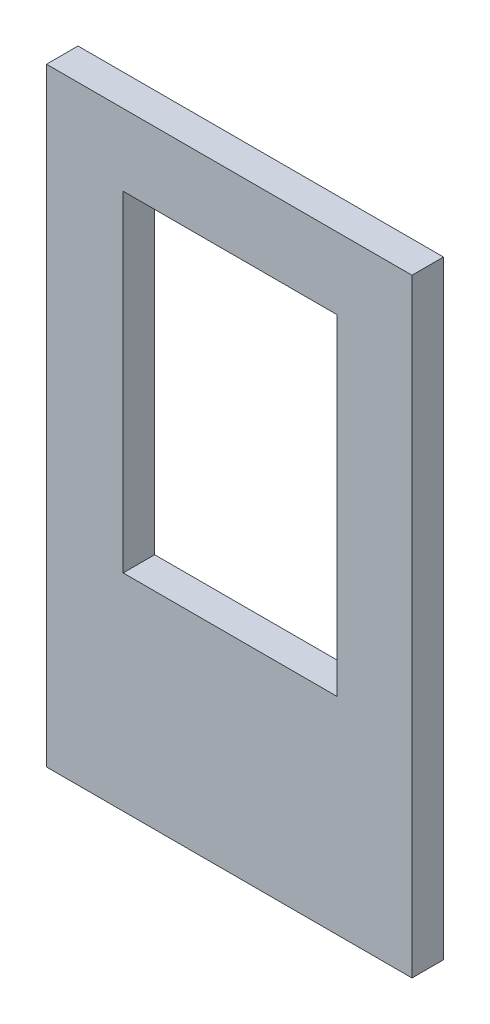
ISO-10303-21;
HEADER;
FILE_DESCRIPTION(('STEP AP214'),'2;1');
FILE_NAME('part.step','',(''),(''),'','','');
FILE_SCHEMA(('AUTOMOTIVE_DESIGN { 1 0 10303 214 1 1 1 1 }'));
ENDSEC;
DATA;
#1=APPLICATION_CONTEXT('core data for automotive mechanical design processes');
#2=APPLICATION_PROTOCOL_DEFINITION('international standard','automotive_design',2000,#1);
#3=PRODUCT_CONTEXT('',#1,'mechanical');
#4=PRODUCT('Part','Part','',(#3));
#5=PRODUCT_RELATED_PRODUCT_CATEGORY('part','',(#4));
#6=PRODUCT_DEFINITION_FORMATION('','',#4);
#7=PRODUCT_DEFINITION_CONTEXT('part definition',#1,'design');
#8=PRODUCT_DEFINITION('design','',#6,#7);
#9=PRODUCT_DEFINITION_SHAPE('','',#8);
#10=(LENGTH_UNIT() NAMED_UNIT(*) SI_UNIT(.MILLI.,.METRE.));
#11=(NAMED_UNIT(*) PLANE_ANGLE_UNIT() SI_UNIT($,.RADIAN.));
#12=(NAMED_UNIT(*) SI_UNIT($,.STERADIAN.) SOLID_ANGLE_UNIT());
#13=UNCERTAINTY_MEASURE_WITH_UNIT(LENGTH_MEASURE(1.E-05),#10,'distance_accuracy_value','');
#14=(GEOMETRIC_REPRESENTATION_CONTEXT(3) GLOBAL_UNCERTAINTY_ASSIGNED_CONTEXT((#13)) GLOBAL_UNIT_ASSIGNED_CONTEXT((#10,
#11,#12)) REPRESENTATION_CONTEXT('',''));
#15=CARTESIAN_POINT('',(0.,0.,0.));
#16=DIRECTION('',(0.,0.,1.));
#17=DIRECTION('',(1.,0.,0.));
#18=AXIS2_PLACEMENT_3D('',#15,#16,#17);
#19=CARTESIAN_POINT('',(59.15,98.5,5.1));
#20=DIRECTION('',(-1.,0.,0.));
#21=DIRECTION('',(0.,-1.,0.));
#22=AXIS2_PLACEMENT_3D('',#19,#20,#21);
#23=PLANE('',#22);
#24=DIRECTION('',(0.,1.,0.));
#25=VECTOR('',#24,1.);
#26=CARTESIAN_POINT('',(59.15,98.5,-5.1));
#27=LINE('',#26,#25);
#28=CARTESIAN_POINT('',(59.15,-98.5,-5.1));
#29=VERTEX_POINT('',#28);
#30=CARTESIAN_POINT('',(59.15,98.5,-5.1));
#31=VERTEX_POINT('',#30);
#32=EDGE_CURVE('E119',#29,#31,#27,.T.);
#33=ORIENTED_EDGE('',*,*,#32,.T.);
#34=DIRECTION('',(0.,0.,-1.));
#35=VECTOR('',#34,1.);
#36=CARTESIAN_POINT('',(59.15,98.5,5.1));
#37=LINE('',#36,#35);
#38=CARTESIAN_POINT('',(59.15,98.5,5.1));
#39=VERTEX_POINT('',#38);
#40=EDGE_CURVE('E150',#39,#31,#37,.T.);
#41=ORIENTED_EDGE('',*,*,#40,.F.);
#42=DIRECTION('',(0.,1.,0.));
#43=VECTOR('',#42,1.);
#44=CARTESIAN_POINT('',(59.15,98.5,5.1));
#45=LINE('',#44,#43);
#46=CARTESIAN_POINT('',(59.15,-98.5,5.1));
#47=VERTEX_POINT('',#46);
#48=EDGE_CURVE('E124',#47,#39,#45,.T.);
#49=ORIENTED_EDGE('',*,*,#48,.F.);
#50=DIRECTION('',(0.,0.,-1.));
#51=VECTOR('',#50,1.);
#52=CARTESIAN_POINT('',(59.15,-98.5,5.1));
#53=LINE('',#52,#51);
#54=EDGE_CURVE('E134',#47,#29,#53,.T.);
#55=ORIENTED_EDGE('',*,*,#54,.T.);
#56=EDGE_LOOP('',(#33,#41,#49,#55));
#57=FACE_BOUND('',#56,.T.);
#58=ADVANCED_FACE('F32',(#57),#23,.F.);
#59=CARTESIAN_POINT('',(-59.15,98.5,5.1));
#60=DIRECTION('',(0.,-1.,0.));
#61=DIRECTION('',(0.,0.,-1.));
#62=AXIS2_PLACEMENT_3D('',#59,#60,#61);
#63=PLANE('',#62);
#64=DIRECTION('',(-1.,0.,0.));
#65=VECTOR('',#64,1.);
#66=CARTESIAN_POINT('',(-59.15,98.5,-5.1));
#67=LINE('',#66,#65);
#68=CARTESIAN_POINT('',(-59.15,98.5,-5.1));
#69=VERTEX_POINT('',#68);
#70=EDGE_CURVE('E137',#31,#69,#67,.T.);
#71=ORIENTED_EDGE('',*,*,#70,.T.);
#72=DIRECTION('',(0.,0.,-1.));
#73=VECTOR('',#72,1.);
#74=CARTESIAN_POINT('',(-59.15,98.5,5.1));
#75=LINE('',#74,#73);
#76=CARTESIAN_POINT('',(-59.15,98.5,5.1));
#77=VERTEX_POINT('',#76);
#78=EDGE_CURVE('E147',#77,#69,#75,.T.);
#79=ORIENTED_EDGE('',*,*,#78,.F.);
#80=DIRECTION('',(-1.,0.,0.));
#81=VECTOR('',#80,1.);
#82=CARTESIAN_POINT('',(-59.15,98.5,5.1));
#83=LINE('',#82,#81);
#84=EDGE_CURVE('E127',#39,#77,#83,.T.);
#85=ORIENTED_EDGE('',*,*,#84,.F.);
#86=ORIENTED_EDGE('',*,*,#40,.T.);
#87=EDGE_LOOP('',(#71,#79,#85,#86));
#88=FACE_BOUND('',#87,.T.);
#89=ADVANCED_FACE('F173',(#88),#63,.F.);
#90=CARTESIAN_POINT('',(-59.15,98.5,5.1));
#91=DIRECTION('',(1.,0.,0.));
#92=DIRECTION('',(0.,1.,0.));
#93=AXIS2_PLACEMENT_3D('',#90,#91,#92);
#94=PLANE('',#93);
#95=DIRECTION('',(0.,-1.,0.));
#96=VECTOR('',#95,1.);
#97=CARTESIAN_POINT('',(-59.15,98.5,-5.1));
#98=LINE('',#97,#96);
#99=CARTESIAN_POINT('',(-59.15,-98.5,-5.1));
#100=VERTEX_POINT('',#99);
#101=EDGE_CURVE('E139',#69,#100,#98,.T.);
#102=ORIENTED_EDGE('',*,*,#101,.T.);
#103=DIRECTION('',(0.,0.,-1.));
#104=VECTOR('',#103,1.);
#105=CARTESIAN_POINT('',(-59.15,-98.5,5.1));
#106=LINE('',#105,#104);
#107=CARTESIAN_POINT('',(-59.15,-98.5,5.1));
#108=VERTEX_POINT('',#107);
#109=EDGE_CURVE('E144',#108,#100,#106,.T.);
#110=ORIENTED_EDGE('',*,*,#109,.F.);
#111=DIRECTION('',(0.,-1.,0.));
#112=VECTOR('',#111,1.);
#113=CARTESIAN_POINT('',(-59.15,98.5,5.1));
#114=LINE('',#113,#112);
#115=EDGE_CURVE('E130',#77,#108,#114,.T.);
#116=ORIENTED_EDGE('',*,*,#115,.F.);
#117=ORIENTED_EDGE('',*,*,#78,.T.);
#118=EDGE_LOOP('',(#102,#110,#116,#117));
#119=FACE_BOUND('',#118,.T.);
#120=ADVANCED_FACE('F178',(#119),#94,.F.);
#121=CARTESIAN_POINT('',(-59.15,-98.5,5.1));
#122=DIRECTION('',(0.,1.,0.));
#123=DIRECTION('',(0.,0.,1.));
#124=AXIS2_PLACEMENT_3D('',#121,#122,#123);
#125=PLANE('',#124);
#126=DIRECTION('',(1.,0.,0.));
#127=VECTOR('',#126,1.);
#128=CARTESIAN_POINT('',(-59.15,-98.5,-5.1));
#129=LINE('',#128,#127);
#130=EDGE_CURVE('E128',#100,#29,#129,.T.);
#131=ORIENTED_EDGE('',*,*,#130,.T.);
#132=ORIENTED_EDGE('',*,*,#54,.F.);
#133=DIRECTION('',(1.,0.,0.));
#134=VECTOR('',#133,1.);
#135=CARTESIAN_POINT('',(-59.15,-98.5,5.1));
#136=LINE('',#135,#134);
#137=EDGE_CURVE('E132',#108,#47,#136,.T.);
#138=ORIENTED_EDGE('',*,*,#137,.F.);
#139=ORIENTED_EDGE('',*,*,#109,.T.);
#140=EDGE_LOOP('',(#131,#132,#138,#139));
#141=FACE_BOUND('',#140,.T.);
#142=ADVANCED_FACE('F191',(#141),#125,.F.);
#143=CARTESIAN_POINT('',(0.,0.,5.1));
#144=DIRECTION('',(0.,0.,1.));
#145=DIRECTION('',(1.,0.,0.));
#146=AXIS2_PLACEMENT_3D('',#143,#144,#145);
#147=PLANE('',#146);
#148=DIRECTION('',(0.,-1.,0.));
#149=VECTOR('',#148,1.);
#150=CARTESIAN_POINT('',(34.9499999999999,75.3000000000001,5.1));
#151=LINE('',#150,#149);
#152=CARTESIAN_POINT('',(34.9499999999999,75.3000000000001,5.1));
#153=VERTEX_POINT('',#152);
#154=CARTESIAN_POINT('',(34.9499999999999,-31.6999999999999,5.10000000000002));
#155=VERTEX_POINT('',#154);
#156=EDGE_CURVE('E99',#153,#155,#151,.T.);
#157=ORIENTED_EDGE('',*,*,#156,.T.);
#158=DIRECTION('',(-1.,0.,0.));
#159=VECTOR('',#158,1.);
#160=CARTESIAN_POINT('',(34.9499999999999,-31.6999999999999,5.10000000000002));
#161=LINE('',#160,#159);
#162=CARTESIAN_POINT('',(-34.3500000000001,-31.6999999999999,5.1));
#163=VERTEX_POINT('',#162);
#164=EDGE_CURVE('E106',#155,#163,#161,.T.);
#165=ORIENTED_EDGE('',*,*,#164,.T.);
#166=DIRECTION('',(0.,1.,0.));
#167=VECTOR('',#166,1.);
#168=CARTESIAN_POINT('',(-34.3500000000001,75.3000000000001,5.1));
#169=LINE('',#168,#167);
#170=CARTESIAN_POINT('',(-34.3500000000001,75.3000000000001,5.1));
#171=VERTEX_POINT('',#170);
#172=EDGE_CURVE('E46',#163,#171,#169,.T.);
#173=ORIENTED_EDGE('',*,*,#172,.T.);
#174=DIRECTION('',(1.,0.,0.));
#175=VECTOR('',#174,1.);
#176=CARTESIAN_POINT('',(34.9499999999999,75.3000000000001,5.1));
#177=LINE('',#176,#175);
#178=EDGE_CURVE('E103',#171,#153,#177,.T.);
#179=ORIENTED_EDGE('',*,*,#178,.T.);
#180=EDGE_LOOP('',(#157,#165,#173,#179));
#181=FACE_BOUND('',#180,.T.);
#182=ORIENTED_EDGE('',*,*,#48,.T.);
#183=ORIENTED_EDGE('',*,*,#84,.T.);
#184=ORIENTED_EDGE('',*,*,#115,.T.);
#185=ORIENTED_EDGE('',*,*,#137,.T.);
#186=EDGE_LOOP('',(#182,#183,#184,#185));
#187=FACE_BOUND('',#186,.T.);
#188=ADVANCED_FACE('F110',(#181,#187),#147,.T.);
#189=CARTESIAN_POINT('',(0.,0.,-5.1));
#190=DIRECTION('',(0.,0.,1.));
#191=DIRECTION('',(1.,0.,0.));
#192=AXIS2_PLACEMENT_3D('',#189,#190,#191);
#193=PLANE('',#192);
#194=DIRECTION('',(1.,0.,0.));
#195=VECTOR('',#194,1.);
#196=CARTESIAN_POINT('',(0.,-31.6999999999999,-5.1));
#197=LINE('',#196,#195);
#198=CARTESIAN_POINT('',(-34.3500000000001,-31.6999999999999,-5.1));
#199=VERTEX_POINT('',#198);
#200=CARTESIAN_POINT('',(34.9499999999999,-31.6999999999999,-5.1));
#201=VERTEX_POINT('',#200);
#202=EDGE_CURVE('E153',#199,#201,#197,.T.);
#203=ORIENTED_EDGE('',*,*,#202,.T.);
#204=DIRECTION('',(0.,1.,0.));
#205=VECTOR('',#204,1.);
#206=CARTESIAN_POINT('',(34.9499999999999,0.,-5.1));
#207=LINE('',#206,#205);
#208=CARTESIAN_POINT('',(34.9499999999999,75.3000000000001,-5.1));
#209=VERTEX_POINT('',#208);
#210=EDGE_CURVE('E11',#201,#209,#207,.T.);
#211=ORIENTED_EDGE('',*,*,#210,.T.);
#212=DIRECTION('',(-1.,0.,0.));
#213=VECTOR('',#212,1.);
#214=CARTESIAN_POINT('',(0.,75.3000000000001,-5.1));
#215=LINE('',#214,#213);
#216=CARTESIAN_POINT('',(-34.3500000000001,75.3000000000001,-5.1));
#217=VERTEX_POINT('',#216);
#218=EDGE_CURVE('E39',#209,#217,#215,.T.);
#219=ORIENTED_EDGE('',*,*,#218,.T.);
#220=DIRECTION('',(0.,-1.,0.));
#221=VECTOR('',#220,1.);
#222=CARTESIAN_POINT('',(-34.3500000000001,0.,-5.1));
#223=LINE('',#222,#221);
#224=EDGE_CURVE('E155',#217,#199,#223,.T.);
#225=ORIENTED_EDGE('',*,*,#224,.T.);
#226=EDGE_LOOP('',(#203,#211,#219,#225));
#227=FACE_BOUND('',#226,.T.);
#228=ORIENTED_EDGE('',*,*,#32,.F.);
#229=ORIENTED_EDGE('',*,*,#130,.F.);
#230=ORIENTED_EDGE('',*,*,#101,.F.);
#231=ORIENTED_EDGE('',*,*,#70,.F.);
#232=EDGE_LOOP('',(#228,#229,#230,#231));
#233=FACE_BOUND('',#232,.T.);
#234=ADVANCED_FACE('F159',(#227,#233),#193,.F.);
#235=CARTESIAN_POINT('',(34.9499999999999,75.3000000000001,5.1));
#236=DIRECTION('',(1.,0.,0.));
#237=DIRECTION('',(0.,0.,-1.));
#238=AXIS2_PLACEMENT_3D('',#235,#236,#237);
#239=PLANE('',#238);
#240=DIRECTION('',(0.,0.,-1.));
#241=VECTOR('',#240,1.);
#242=CARTESIAN_POINT('',(34.9499999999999,-31.6999999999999,5.10000000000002));
#243=LINE('',#242,#241);
#244=EDGE_CURVE('E54',#155,#201,#243,.T.);
#245=ORIENTED_EDGE('',*,*,#244,.F.);
#246=ORIENTED_EDGE('',*,*,#156,.F.);
#247=DIRECTION('',(0.,0.,-1.));
#248=VECTOR('',#247,1.);
#249=CARTESIAN_POINT('',(34.9499999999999,75.3000000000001,5.1));
#250=LINE('',#249,#248);
#251=EDGE_CURVE('E117',#153,#209,#250,.T.);
#252=ORIENTED_EDGE('',*,*,#251,.T.);
#253=ORIENTED_EDGE('',*,*,#210,.F.);
#254=EDGE_LOOP('',(#245,#246,#252,#253));
#255=FACE_BOUND('',#254,.T.);
#256=ADVANCED_FACE('F96',(#255),#239,.F.);
#257=CARTESIAN_POINT('',(34.9499999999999,75.3000000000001,5.1));
#258=DIRECTION('',(0.,1.,0.));
#259=DIRECTION('',(0.,0.,1.));
#260=AXIS2_PLACEMENT_3D('',#257,#258,#259);
#261=PLANE('',#260);
#262=ORIENTED_EDGE('',*,*,#251,.F.);
#263=ORIENTED_EDGE('',*,*,#178,.F.);
#264=DIRECTION('',(0.,0.,-1.));
#265=VECTOR('',#264,1.);
#266=CARTESIAN_POINT('',(-34.3500000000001,75.3000000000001,5.1));
#267=LINE('',#266,#265);
#268=EDGE_CURVE('E120',#171,#217,#267,.T.);
#269=ORIENTED_EDGE('',*,*,#268,.T.);
#270=ORIENTED_EDGE('',*,*,#218,.F.);
#271=EDGE_LOOP('',(#262,#263,#269,#270));
#272=FACE_BOUND('',#271,.T.);
#273=ADVANCED_FACE('F162',(#272),#261,.F.);
#274=CARTESIAN_POINT('',(-34.3500000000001,75.3000000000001,5.1));
#275=DIRECTION('',(-1.,0.,0.));
#276=DIRECTION('',(0.,0.,1.));
#277=AXIS2_PLACEMENT_3D('',#274,#275,#276);
#278=PLANE('',#277);
#279=ORIENTED_EDGE('',*,*,#268,.F.);
#280=ORIENTED_EDGE('',*,*,#172,.F.);
#281=DIRECTION('',(0.,0.,-1.));
#282=VECTOR('',#281,1.);
#283=CARTESIAN_POINT('',(-34.3500000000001,-31.6999999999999,5.10000000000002));
#284=LINE('',#283,#282);
#285=EDGE_CURVE('E102',#163,#199,#284,.T.);
#286=ORIENTED_EDGE('',*,*,#285,.T.);
#287=ORIENTED_EDGE('',*,*,#224,.F.);
#288=EDGE_LOOP('',(#279,#280,#286,#287));
#289=FACE_BOUND('',#288,.T.);
#290=ADVANCED_FACE('F163',(#289),#278,.F.);
#291=CARTESIAN_POINT('',(34.9499999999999,-31.6999999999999,5.10000000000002));
#292=DIRECTION('',(0.,-1.,0.));
#293=DIRECTION('',(0.,0.,-1.));
#294=AXIS2_PLACEMENT_3D('',#291,#292,#293);
#295=PLANE('',#294);
#296=ORIENTED_EDGE('',*,*,#285,.F.);
#297=ORIENTED_EDGE('',*,*,#164,.F.);
#298=ORIENTED_EDGE('',*,*,#244,.T.);
#299=ORIENTED_EDGE('',*,*,#202,.F.);
#300=EDGE_LOOP('',(#296,#297,#298,#299));
#301=FACE_BOUND('',#300,.T.);
#302=ADVANCED_FACE('F107',(#301),#295,.F.);
#303=CLOSED_SHELL('',(#58,#89,#120,#142,#188,#234,#256,#273,#290,#302));
#304=MANIFOLD_SOLID_BREP('B2',#303);
#305=ADVANCED_BREP_SHAPE_REPRESENTATION('',(#18,#304),#14);
#306=SHAPE_DEFINITION_REPRESENTATION(#9,#305);
ENDSEC;
END-ISO-10303-21;
